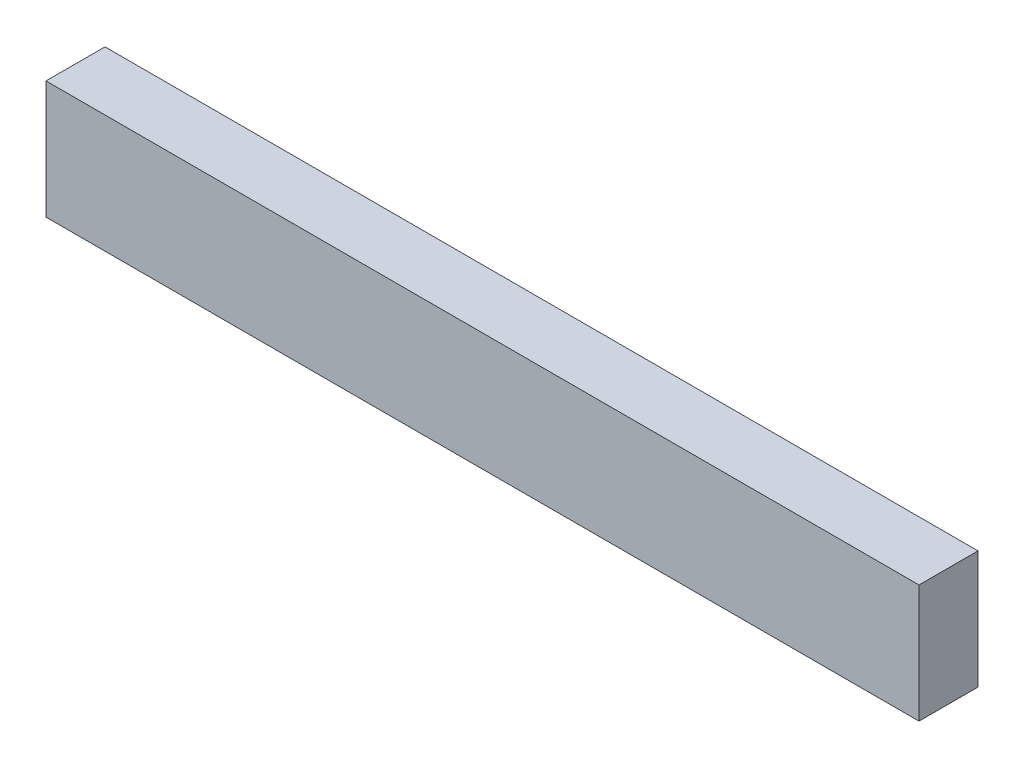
ISO-10303-21;
HEADER;
FILE_DESCRIPTION(('STEP AP214'),'2;1');
FILE_NAME('part.step','',(''),(''),'','','');
FILE_SCHEMA(('AUTOMOTIVE_DESIGN { 1 0 10303 214 1 1 1 1 }'));
ENDSEC;
DATA;
#1=APPLICATION_CONTEXT('core data for automotive mechanical design processes');
#2=APPLICATION_PROTOCOL_DEFINITION('international standard','automotive_design',2000,#1);
#3=PRODUCT_CONTEXT('',#1,'mechanical');
#4=PRODUCT('Part','Part','',(#3));
#5=PRODUCT_RELATED_PRODUCT_CATEGORY('part','',(#4));
#6=PRODUCT_DEFINITION_FORMATION('','',#4);
#7=PRODUCT_DEFINITION_CONTEXT('part definition',#1,'design');
#8=PRODUCT_DEFINITION('design','',#6,#7);
#9=PRODUCT_DEFINITION_SHAPE('','',#8);
#10=(LENGTH_UNIT() NAMED_UNIT(*) SI_UNIT(.MILLI.,.METRE.));
#11=(NAMED_UNIT(*) PLANE_ANGLE_UNIT() SI_UNIT($,.RADIAN.));
#12=(NAMED_UNIT(*) SI_UNIT($,.STERADIAN.) SOLID_ANGLE_UNIT());
#13=UNCERTAINTY_MEASURE_WITH_UNIT(LENGTH_MEASURE(1.E-05),#10,'distance_accuracy_value','');
#14=(GEOMETRIC_REPRESENTATION_CONTEXT(3) GLOBAL_UNCERTAINTY_ASSIGNED_CONTEXT((#13)) GLOBAL_UNIT_ASSIGNED_CONTEXT((#10,
#11,#12)) REPRESENTATION_CONTEXT('',''));
#15=CARTESIAN_POINT('',(0.,0.,0.));
#16=DIRECTION('',(0.,0.,1.));
#17=DIRECTION('',(1.,0.,0.));
#18=AXIS2_PLACEMENT_3D('',#15,#16,#17);
#19=CARTESIAN_POINT('',(185.,25.,25.));
#20=DIRECTION('',(-1.,0.,0.));
#21=DIRECTION('',(0.,0.,1.));
#22=AXIS2_PLACEMENT_3D('',#19,#20,#21);
#23=PLANE('',#22);
#24=DIRECTION('',(0.,1.,0.));
#25=VECTOR('',#24,1.);
#26=CARTESIAN_POINT('',(185.,25.,0.));
#27=LINE('',#26,#25);
#28=CARTESIAN_POINT('',(185.,-25.,0.));
#29=VERTEX_POINT('',#28);
#30=CARTESIAN_POINT('',(185.,25.,0.));
#31=VERTEX_POINT('',#30);
#32=EDGE_CURVE('E102',#29,#31,#27,.T.);
#33=ORIENTED_EDGE('',*,*,#32,.T.);
#34=DIRECTION('',(0.,0.,-1.));
#35=VECTOR('',#34,1.);
#36=CARTESIAN_POINT('',(185.,25.,25.));
#37=LINE('',#36,#35);
#38=CARTESIAN_POINT('',(185.,25.,25.));
#39=VERTEX_POINT('',#38);
#40=EDGE_CURVE('E11',#39,#31,#37,.T.);
#41=ORIENTED_EDGE('',*,*,#40,.F.);
#42=DIRECTION('',(0.,1.,0.));
#43=VECTOR('',#42,1.);
#44=CARTESIAN_POINT('',(185.,25.,25.));
#45=LINE('',#44,#43);
#46=CARTESIAN_POINT('',(185.,-25.,25.));
#47=VERTEX_POINT('',#46);
#48=EDGE_CURVE('E90',#47,#39,#45,.T.);
#49=ORIENTED_EDGE('',*,*,#48,.F.);
#50=DIRECTION('',(0.,0.,-1.));
#51=VECTOR('',#50,1.);
#52=CARTESIAN_POINT('',(185.,-25.,25.));
#53=LINE('',#52,#51);
#54=EDGE_CURVE('E98',#47,#29,#53,.T.);
#55=ORIENTED_EDGE('',*,*,#54,.T.);
#56=EDGE_LOOP('',(#33,#41,#49,#55));
#57=FACE_BOUND('',#56,.T.);
#58=ADVANCED_FACE('F39',(#57),#23,.F.);
#59=CARTESIAN_POINT('',(-185.,25.,25.));
#60=DIRECTION('',(0.,-1.,0.));
#61=DIRECTION('',(0.,0.,-1.));
#62=AXIS2_PLACEMENT_3D('',#59,#60,#61);
#63=PLANE('',#62);
#64=DIRECTION('',(-1.,0.,0.));
#65=VECTOR('',#64,1.);
#66=CARTESIAN_POINT('',(-185.,25.,0.));
#67=LINE('',#66,#65);
#68=CARTESIAN_POINT('',(-185.,25.,0.));
#69=VERTEX_POINT('',#68);
#70=EDGE_CURVE('E94',#31,#69,#67,.T.);
#71=ORIENTED_EDGE('',*,*,#70,.T.);
#72=DIRECTION('',(0.,0.,-1.));
#73=VECTOR('',#72,1.);
#74=CARTESIAN_POINT('',(-185.,25.,25.));
#75=LINE('',#74,#73);
#76=CARTESIAN_POINT('',(-185.,25.,25.));
#77=VERTEX_POINT('',#76);
#78=EDGE_CURVE('E47',#77,#69,#75,.T.);
#79=ORIENTED_EDGE('',*,*,#78,.F.);
#80=DIRECTION('',(-1.,0.,0.));
#81=VECTOR('',#80,1.);
#82=CARTESIAN_POINT('',(-185.,25.,25.));
#83=LINE('',#82,#81);
#84=EDGE_CURVE('E85',#39,#77,#83,.T.);
#85=ORIENTED_EDGE('',*,*,#84,.F.);
#86=ORIENTED_EDGE('',*,*,#40,.T.);
#87=EDGE_LOOP('',(#71,#79,#85,#86));
#88=FACE_BOUND('',#87,.T.);
#89=ADVANCED_FACE('F93',(#88),#63,.F.);
#90=CARTESIAN_POINT('',(-185.,25.,25.));
#91=DIRECTION('',(1.,0.,0.));
#92=DIRECTION('',(0.,0.,-1.));
#93=AXIS2_PLACEMENT_3D('',#90,#91,#92);
#94=PLANE('',#93);
#95=DIRECTION('',(0.,-1.,0.));
#96=VECTOR('',#95,1.);
#97=CARTESIAN_POINT('',(-185.,25.,0.));
#98=LINE('',#97,#96);
#99=CARTESIAN_POINT('',(-185.,-25.,0.));
#100=VERTEX_POINT('',#99);
#101=EDGE_CURVE('E72',#69,#100,#98,.T.);
#102=ORIENTED_EDGE('',*,*,#101,.T.);
#103=DIRECTION('',(0.,0.,-1.));
#104=VECTOR('',#103,1.);
#105=CARTESIAN_POINT('',(-185.,-25.,25.));
#106=LINE('',#105,#104);
#107=CARTESIAN_POINT('',(-185.,-25.,25.));
#108=VERTEX_POINT('',#107);
#109=EDGE_CURVE('E95',#108,#100,#106,.T.);
#110=ORIENTED_EDGE('',*,*,#109,.F.);
#111=DIRECTION('',(0.,-1.,0.));
#112=VECTOR('',#111,1.);
#113=CARTESIAN_POINT('',(-185.,25.,25.));
#114=LINE('',#113,#112);
#115=EDGE_CURVE('E88',#77,#108,#114,.T.);
#116=ORIENTED_EDGE('',*,*,#115,.F.);
#117=ORIENTED_EDGE('',*,*,#78,.T.);
#118=EDGE_LOOP('',(#102,#110,#116,#117));
#119=FACE_BOUND('',#118,.T.);
#120=ADVANCED_FACE('F96',(#119),#94,.F.);
#121=CARTESIAN_POINT('',(-185.,-25.,25.));
#122=DIRECTION('',(0.,1.,0.));
#123=DIRECTION('',(0.,0.,1.));
#124=AXIS2_PLACEMENT_3D('',#121,#122,#123);
#125=PLANE('',#124);
#126=DIRECTION('',(1.,0.,0.));
#127=VECTOR('',#126,1.);
#128=CARTESIAN_POINT('',(-185.,-25.,0.));
#129=LINE('',#128,#127);
#130=EDGE_CURVE('E78',#100,#29,#129,.T.);
#131=ORIENTED_EDGE('',*,*,#130,.T.);
#132=ORIENTED_EDGE('',*,*,#54,.F.);
#133=DIRECTION('',(1.,0.,0.));
#134=VECTOR('',#133,1.);
#135=CARTESIAN_POINT('',(-185.,-25.,25.));
#136=LINE('',#135,#134);
#137=EDGE_CURVE('E55',#108,#47,#136,.T.);
#138=ORIENTED_EDGE('',*,*,#137,.F.);
#139=ORIENTED_EDGE('',*,*,#109,.T.);
#140=EDGE_LOOP('',(#131,#132,#138,#139));
#141=FACE_BOUND('',#140,.T.);
#142=ADVANCED_FACE('F109',(#141),#125,.F.);
#143=CARTESIAN_POINT('',(0.,0.,25.));
#144=DIRECTION('',(0.,0.,1.));
#145=DIRECTION('',(1.,0.,0.));
#146=AXIS2_PLACEMENT_3D('',#143,#144,#145);
#147=PLANE('',#146);
#148=ORIENTED_EDGE('',*,*,#48,.T.);
#149=ORIENTED_EDGE('',*,*,#84,.T.);
#150=ORIENTED_EDGE('',*,*,#115,.T.);
#151=ORIENTED_EDGE('',*,*,#137,.T.);
#152=EDGE_LOOP('',(#148,#149,#150,#151));
#153=FACE_BOUND('',#152,.T.);
#154=ADVANCED_FACE('F86',(#153),#147,.T.);
#155=CARTESIAN_POINT('',(0.,0.,0.));
#156=DIRECTION('',(0.,0.,1.));
#157=DIRECTION('',(1.,0.,0.));
#158=AXIS2_PLACEMENT_3D('',#155,#156,#157);
#159=PLANE('',#158);
#160=ORIENTED_EDGE('',*,*,#32,.F.);
#161=ORIENTED_EDGE('',*,*,#130,.F.);
#162=ORIENTED_EDGE('',*,*,#101,.F.);
#163=ORIENTED_EDGE('',*,*,#70,.F.);
#164=EDGE_LOOP('',(#160,#161,#162,#163));
#165=FACE_BOUND('',#164,.T.);
#166=ADVANCED_FACE('F112',(#165),#159,.F.);
#167=CLOSED_SHELL('',(#58,#89,#120,#142,#154,#166));
#168=MANIFOLD_SOLID_BREP('B2',#167);
#169=ADVANCED_BREP_SHAPE_REPRESENTATION('',(#18,#168),#14);
#170=SHAPE_DEFINITION_REPRESENTATION(#9,#169);
ENDSEC;
END-ISO-10303-21;
